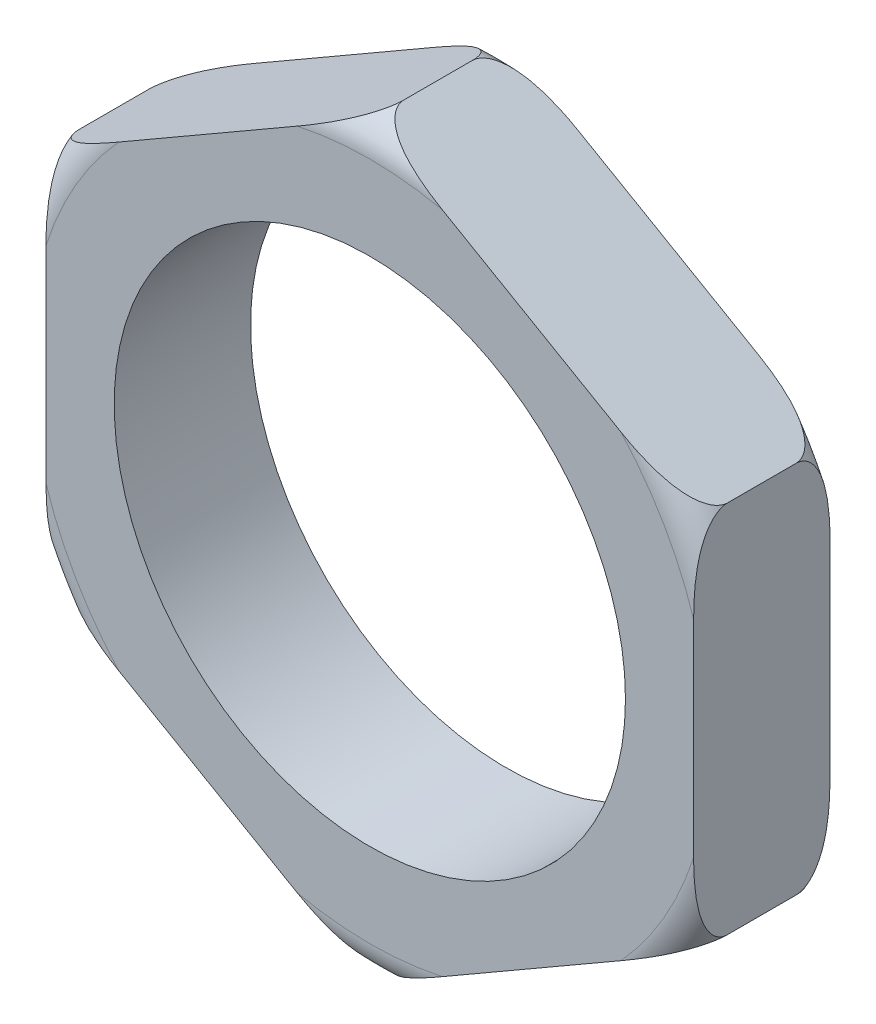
ISO-10303-21;
HEADER;
FILE_DESCRIPTION(('STEP AP214'),'2;1');
FILE_NAME('part.step','',(''),(''),'','','');
FILE_SCHEMA(('AUTOMOTIVE_DESIGN { 1 0 10303 214 1 1 1 1 }'));
ENDSEC;
DATA;
#1=APPLICATION_CONTEXT('core data for automotive mechanical design processes');
#2=APPLICATION_PROTOCOL_DEFINITION('international standard','automotive_design',2000,#1);
#3=PRODUCT_CONTEXT('',#1,'mechanical');
#4=PRODUCT('Part','Part','',(#3));
#5=PRODUCT_RELATED_PRODUCT_CATEGORY('part','',(#4));
#6=PRODUCT_DEFINITION_FORMATION('','',#4);
#7=PRODUCT_DEFINITION_CONTEXT('part definition',#1,'design');
#8=PRODUCT_DEFINITION('design','',#6,#7);
#9=PRODUCT_DEFINITION_SHAPE('','',#8);
#10=(LENGTH_UNIT() NAMED_UNIT(*) SI_UNIT(.MILLI.,.METRE.));
#11=(NAMED_UNIT(*) PLANE_ANGLE_UNIT() SI_UNIT($,.RADIAN.));
#12=(NAMED_UNIT(*) SI_UNIT($,.STERADIAN.) SOLID_ANGLE_UNIT());
#13=UNCERTAINTY_MEASURE_WITH_UNIT(LENGTH_MEASURE(1.E-05),#10,'distance_accuracy_value','');
#14=(GEOMETRIC_REPRESENTATION_CONTEXT(3) GLOBAL_UNCERTAINTY_ASSIGNED_CONTEXT((#13)) GLOBAL_UNIT_ASSIGNED_CONTEXT((#10,
#11,#12)) REPRESENTATION_CONTEXT('',''));
#15=CARTESIAN_POINT('',(0.,0.,0.));
#16=DIRECTION('',(0.,0.,1.));
#17=DIRECTION('',(1.,0.,0.));
#18=AXIS2_PLACEMENT_3D('',#15,#16,#17);
#19=CARTESIAN_POINT('',(0.,0.,15.5));
#20=DIRECTION('',(0.,0.,1.));
#21=DIRECTION('',(1.,0.,0.));
#22=AXIS2_PLACEMENT_3D('',#19,#20,#21);
#23=TOROIDAL_SURFACE('',#22,9.96965511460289,1.);
#24=CARTESIAN_POINT('',(9.5,3.02390858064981,14.5));
#25=CARTESIAN_POINT('',(9.5,3.88125681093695,14.5));
#26=CARTESIAN_POINT('',(9.5,4.44614894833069,14.6454097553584));
#27=CARTESIAN_POINT('',(9.5,4.84647059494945,14.7484571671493));
#28=CARTESIAN_POINT('',(9.5,5.10555316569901,14.9210536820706));
#29=CARTESIAN_POINT('',(9.5,5.27201082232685,15.0319450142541));
#30=CARTESIAN_POINT('',(9.5,5.36829139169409,15.1649452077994));
#31=CARTESIAN_POINT('',(9.5,5.48482755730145,15.3259261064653));
#32=CARTESIAN_POINT('',(9.5,5.48482755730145,15.5));
#33=B_SPLINE_CURVE_WITH_KNOTS('',2,(#24,#25,#26,#27,#28,#29,#30,#31,#32),.UNSPECIFIED.,.F.,.F.,
(3,2,2,2,3),(0.,0.5,0.75,0.875,1.),.UNSPECIFIED.);
#34=CARTESIAN_POINT('',(9.5,3.02390858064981,14.5));
#35=VERTEX_POINT('',#34);
#36=CARTESIAN_POINT('',(9.5,5.48482755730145,15.5));
#37=VERTEX_POINT('',#36);
#38=EDGE_CURVE('E510',#35,#37,#33,.T.);
#39=ORIENTED_EDGE('',*,*,#38,.F.);
#40=CARTESIAN_POINT('',(0.,0.,14.5));
#41=DIRECTION('',(0.,0.,1.));
#42=DIRECTION('',(1.,0.,0.));
#43=AXIS2_PLACEMENT_3D('',#40,#41,#42);
#44=CIRCLE('',#43,9.96965511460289);
#45=CARTESIAN_POINT('',(7.36878164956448,6.71528704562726,14.5));
#46=VERTEX_POINT('',#45);
#47=EDGE_CURVE('E652',#35,#46,#44,.T.);
#48=ORIENTED_EDGE('',*,*,#47,.T.);
#49=CARTESIAN_POINT('',(9.5,5.48482755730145,15.5));
#50=CARTESIAN_POINT('',(9.5,5.48482755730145,15.3253370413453));
#51=CARTESIAN_POINT('',(9.39786028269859,5.54379795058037,15.1630084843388));
#52=CARTESIAN_POINT('',(9.31453432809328,5.59190621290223,15.0305802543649));
#53=CARTESIAN_POINT('',(9.16885617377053,5.67601353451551,14.9189945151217));
#54=CARTESIAN_POINT('',(8.94447002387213,5.80556293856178,14.7471204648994));
#55=CARTESIAN_POINT('',(8.59618172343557,6.00664728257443,14.6441360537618));
#56=CARTESIAN_POINT('',(8.1087205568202,6.2880831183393,14.5));
#57=CARTESIAN_POINT('',(7.36878164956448,6.71528704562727,14.5));
#58=B_SPLINE_CURVE_WITH_KNOTS('',2,(#49,#50,#51,#52,#53,#54,#55,#56,#57),.UNSPECIFIED.,.F.,.F.,
(3,2,2,2,3),(0.,0.125,0.25,0.5,1.),.UNSPECIFIED.);
#59=EDGE_CURVE('E635',#37,#46,#58,.T.);
#60=ORIENTED_EDGE('',*,*,#59,.F.);
#61=EDGE_LOOP('',(#39,#48,#60));
#62=FACE_BOUND('',#61,.T.);
#63=ADVANCED_FACE('F17',(#62),#23,.T.);
#64=CARTESIAN_POINT('',(0.,0.,15.5));
#65=DIRECTION('',(0.,0.,1.));
#66=DIRECTION('',(1.,0.,0.));
#67=AXIS2_PLACEMENT_3D('',#64,#65,#66);
#68=TOROIDAL_SURFACE('',#67,9.96965511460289,1.);
#69=CARTESIAN_POINT('',(0.,0.,14.5));
#70=DIRECTION('',(0.,0.,1.));
#71=DIRECTION('',(1.,0.,0.));
#72=AXIS2_PLACEMENT_3D('',#69,#70,#71);
#73=CIRCLE('',#72,9.96965511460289);
#74=CARTESIAN_POINT('',(2.13121835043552,9.73919562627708,14.5));
#75=VERTEX_POINT('',#74);
#76=CARTESIAN_POINT('',(-2.13121835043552,9.73919562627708,14.5));
#77=VERTEX_POINT('',#76);
#78=EDGE_CURVE('E11',#75,#77,#73,.T.);
#79=ORIENTED_EDGE('',*,*,#78,.T.);
#80=CARTESIAN_POINT('',(0.,10.9696551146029,15.5));
#81=CARTESIAN_POINT('',(0.,10.9696551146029,15.3253370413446));
#82=CARTESIAN_POINT('',(-0.102139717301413,10.910684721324,15.1630084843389));
#83=CARTESIAN_POINT('',(-0.185465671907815,10.8625764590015,15.0305802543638));
#84=CARTESIAN_POINT('',(-0.331143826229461,10.7784691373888,14.9189945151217));
#85=CARTESIAN_POINT('',(-0.555529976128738,10.6489197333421,14.7471204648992));
#86=CARTESIAN_POINT('',(-0.903818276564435,10.4478353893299,14.6441360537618));
#87=CARTESIAN_POINT('',(-1.3912794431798,10.166399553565,14.5));
#88=CARTESIAN_POINT('',(-2.13121835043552,9.73919562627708,14.5));
#89=B_SPLINE_CURVE_WITH_KNOTS('',2,(#80,#81,#82,#83,#84,#85,#86,#87,#88),.UNSPECIFIED.,.F.,.F.,
(3,2,2,2,3),(0.,0.125,0.25,0.5,1.),.UNSPECIFIED.);
#90=CARTESIAN_POINT('',(0.,10.9696551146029,15.5));
#91=VERTEX_POINT('',#90);
#92=EDGE_CURVE('E207',#91,#77,#89,.T.);
#93=ORIENTED_EDGE('',*,*,#92,.F.);
#94=CARTESIAN_POINT('',(2.13121835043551,9.73919562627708,14.5));
#95=CARTESIAN_POINT('',(1.38867704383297,10.1679020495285,14.5));
#96=CARTESIAN_POINT('',(0.899457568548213,10.4503530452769,14.6454289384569));
#97=CARTESIAN_POINT('',(0.552712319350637,10.6505465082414,14.7485049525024));
#98=CARTESIAN_POINT('',(0.328351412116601,10.7800813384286,14.9211382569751));
#99=CARTESIAN_POINT('',(0.184382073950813,10.8632020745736,15.0319146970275));
#100=CARTESIAN_POINT('',(0.101063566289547,10.9113060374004,15.1647211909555));
#101=CARTESIAN_POINT('',(0.,10.9696551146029,15.3258126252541));
#102=CARTESIAN_POINT('',(0.,10.9696551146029,15.5));
#103=B_SPLINE_CURVE_WITH_KNOTS('',2,(#94,#95,#96,#97,#98,#99,#100,#101,#102),.UNSPECIFIED.,.F.,
.F.,(3,2,2,2,3),(0.,0.5,0.75,0.875,1.),.UNSPECIFIED.);
#104=EDGE_CURVE('E211',#75,#91,#103,.T.);
#105=ORIENTED_EDGE('',*,*,#104,.F.);
#106=EDGE_LOOP('',(#79,#93,#105));
#107=FACE_BOUND('',#106,.T.);
#108=ADVANCED_FACE('F205',(#107),#68,.T.);
#109=CARTESIAN_POINT('',(0.,0.,15.5));
#110=DIRECTION('',(0.,0.,1.));
#111=DIRECTION('',(1.,0.,0.));
#112=AXIS2_PLACEMENT_3D('',#109,#110,#111);
#113=TOROIDAL_SURFACE('',#112,9.96965511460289,1.);
#114=CARTESIAN_POINT('',(-7.36878164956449,6.71528704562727,14.5));
#115=CARTESIAN_POINT('',(-8.11132295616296,6.28658062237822,14.5));
#116=CARTESIAN_POINT('',(-8.60054243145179,6.00412962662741,14.6454289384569));
#117=CARTESIAN_POINT('',(-8.94728768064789,5.80393616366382,14.7485049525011));
#118=CARTESIAN_POINT('',(-9.17164858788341,5.67440133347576,14.9211382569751));
#119=CARTESIAN_POINT('',(-9.31561792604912,5.59128059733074,15.0319146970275));
#120=CARTESIAN_POINT('',(-9.39893643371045,5.54317663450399,15.1647211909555));
#121=CARTESIAN_POINT('',(-9.50000000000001,5.48482755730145,15.3258126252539));
#122=CARTESIAN_POINT('',(-9.50000000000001,5.48482755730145,15.5));
#123=B_SPLINE_CURVE_WITH_KNOTS('',2,(#114,#115,#116,#117,#118,#119,#120,#121,#122),
.UNSPECIFIED.,.F.,.F.,(3,2,2,2,3),(0.,0.5,0.75,0.875,1.),.UNSPECIFIED.);
#124=CARTESIAN_POINT('',(-7.36878164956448,6.71528704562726,14.5));
#125=VERTEX_POINT('',#124);
#126=CARTESIAN_POINT('',(-9.5,5.48482755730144,15.5));
#127=VERTEX_POINT('',#126);
#128=EDGE_CURVE('E220',#125,#127,#123,.T.);
#129=ORIENTED_EDGE('',*,*,#128,.F.);
#130=CARTESIAN_POINT('',(0.,0.,14.5));
#131=DIRECTION('',(0.,0.,1.));
#132=DIRECTION('',(1.,0.,0.));
#133=AXIS2_PLACEMENT_3D('',#130,#131,#132);
#134=CIRCLE('',#133,9.96965511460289);
#135=CARTESIAN_POINT('',(-9.5,3.0239085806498,14.5));
#136=VERTEX_POINT('',#135);
#137=EDGE_CURVE('E31',#125,#136,#134,.T.);
#138=ORIENTED_EDGE('',*,*,#137,.T.);
#139=CARTESIAN_POINT('',(-9.5,5.48482755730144,15.5));
#140=CARTESIAN_POINT('',(-9.5,5.48482755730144,15.3253112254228));
#141=CARTESIAN_POINT('',(-9.5,5.3668455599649,15.1629518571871));
#142=CARTESIAN_POINT('',(-9.5,5.27060561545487,15.0305125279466));
#143=CARTESIAN_POINT('',(-9.5,5.10232945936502,14.918910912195));
#144=CARTESIAN_POINT('',(-9.5,4.84280265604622,14.746791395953));
#145=CARTESIAN_POINT('',(-9.5,4.43979630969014,14.6437801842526));
#146=CARTESIAN_POINT('',(-9.5,3.87729126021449,14.5));
#147=CARTESIAN_POINT('',(-9.5,3.0239085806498,14.5));
#148=B_SPLINE_CURVE_WITH_KNOTS('',2,(#139,#140,#141,#142,#143,#144,#145,#146,#147),
.UNSPECIFIED.,.F.,.F.,(3,2,2,2,3),(0.,0.125,0.25,0.5,1.),.UNSPECIFIED.);
#149=EDGE_CURVE('E227',#127,#136,#148,.T.);
#150=ORIENTED_EDGE('',*,*,#149,.F.);
#151=EDGE_LOOP('',(#129,#138,#150));
#152=FACE_BOUND('',#151,.T.);
#153=ADVANCED_FACE('F282',(#152),#113,.T.);
#154=CARTESIAN_POINT('',(0.,0.,15.5));
#155=DIRECTION('',(0.,0.,1.));
#156=DIRECTION('',(1.,0.,0.));
#157=AXIS2_PLACEMENT_3D('',#154,#155,#156);
#158=TOROIDAL_SURFACE('',#157,9.96965511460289,1.);
#159=CARTESIAN_POINT('',(-9.5,-3.0239085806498,14.5));
#160=CARTESIAN_POINT('',(-9.5,-3.88125681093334,14.5));
#161=CARTESIAN_POINT('',(-9.5,-4.44614894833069,14.6454097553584));
#162=CARTESIAN_POINT('',(-9.5,-4.84647059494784,14.7484571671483));
#163=CARTESIAN_POINT('',(-9.5,-5.105553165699,14.9210536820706));
#164=CARTESIAN_POINT('',(-9.5,-5.27201082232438,15.0319450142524));
#165=CARTESIAN_POINT('',(-9.5,-5.3682913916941,15.1649452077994));
#166=CARTESIAN_POINT('',(-9.5,-5.48482755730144,15.3259261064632));
#167=CARTESIAN_POINT('',(-9.5,-5.48482755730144,15.5));
#168=B_SPLINE_CURVE_WITH_KNOTS('',2,(#159,#160,#161,#162,#163,#164,#165,#166,#167),
.UNSPECIFIED.,.F.,.F.,(3,2,2,2,3),(0.,0.5,0.75,0.875,1.),.UNSPECIFIED.);
#169=CARTESIAN_POINT('',(-9.5,-3.0239085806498,14.5));
#170=VERTEX_POINT('',#169);
#171=CARTESIAN_POINT('',(-9.5,-5.48482755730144,15.5));
#172=VERTEX_POINT('',#171);
#173=EDGE_CURVE('E313',#170,#172,#168,.T.);
#174=ORIENTED_EDGE('',*,*,#173,.F.);
#175=CARTESIAN_POINT('',(0.,0.,14.5));
#176=DIRECTION('',(0.,0.,1.));
#177=DIRECTION('',(1.,0.,0.));
#178=AXIS2_PLACEMENT_3D('',#175,#176,#177);
#179=CIRCLE('',#178,9.96965511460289);
#180=CARTESIAN_POINT('',(-7.36878164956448,-6.71528704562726,14.5));
#181=VERTEX_POINT('',#180);
#182=EDGE_CURVE('E401',#170,#181,#179,.T.);
#183=ORIENTED_EDGE('',*,*,#182,.T.);
#184=CARTESIAN_POINT('',(-9.5,-5.48482755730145,15.5));
#185=CARTESIAN_POINT('',(-9.5,-5.48482755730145,15.3253370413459));
#186=CARTESIAN_POINT('',(-9.39786028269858,-5.54379795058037,15.1630084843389));
#187=CARTESIAN_POINT('',(-9.31453432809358,-5.59190621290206,15.0305802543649));
#188=CARTESIAN_POINT('',(-9.16885617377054,-5.67601353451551,14.9189945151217));
#189=CARTESIAN_POINT('',(-8.94447002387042,-5.80556293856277,14.7471204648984));
#190=CARTESIAN_POINT('',(-8.59618172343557,-6.00664728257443,14.6441360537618));
#191=CARTESIAN_POINT('',(-8.10872055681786,-6.28808311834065,14.5));
#192=CARTESIAN_POINT('',(-7.36878164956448,-6.71528704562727,14.5));
#193=B_SPLINE_CURVE_WITH_KNOTS('',2,(#184,#185,#186,#187,#188,#189,#190,#191,#192),
.UNSPECIFIED.,.F.,.F.,(3,2,2,2,3),(0.,0.125,0.25,0.5,1.),.UNSPECIFIED.);
#194=EDGE_CURVE('E376',#172,#181,#193,.T.);
#195=ORIENTED_EDGE('',*,*,#194,.F.);
#196=EDGE_LOOP('',(#174,#183,#195));
#197=FACE_BOUND('',#196,.T.);
#198=ADVANCED_FACE('F292',(#197),#158,.T.);
#199=CARTESIAN_POINT('',(0.,0.,15.5));
#200=DIRECTION('',(0.,0.,1.));
#201=DIRECTION('',(1.,0.,0.));
#202=AXIS2_PLACEMENT_3D('',#199,#200,#201);
#203=TOROIDAL_SURFACE('',#202,9.96965511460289,1.);
#204=CARTESIAN_POINT('',(-2.13121835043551,-9.73919562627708,14.5));
#205=CARTESIAN_POINT('',(-1.3886770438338,-10.167902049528,14.5));
#206=CARTESIAN_POINT('',(-0.899457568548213,-10.4503530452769,14.6454289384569));
#207=CARTESIAN_POINT('',(-0.552712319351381,-10.650546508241,14.748504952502));
#208=CARTESIAN_POINT('',(-0.328351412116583,-10.7800813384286,14.9211382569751));
#209=CARTESIAN_POINT('',(-0.184382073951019,-10.8632020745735,15.0319146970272));
#210=CARTESIAN_POINT('',(-0.101063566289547,-10.9113060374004,15.1647211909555));
#211=CARTESIAN_POINT('',(0.,-10.9696551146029,15.325812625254));
#212=CARTESIAN_POINT('',(0.,-10.9696551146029,15.5));
#213=B_SPLINE_CURVE_WITH_KNOTS('',2,(#204,#205,#206,#207,#208,#209,#210,#211,#212),
.UNSPECIFIED.,.F.,.F.,(3,2,2,2,3),(0.,0.5,0.75,0.875,1.),.UNSPECIFIED.);
#214=CARTESIAN_POINT('',(-2.13121835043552,-9.73919562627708,14.5));
#215=VERTEX_POINT('',#214);
#216=CARTESIAN_POINT('',(0.,-10.9696551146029,15.5));
#217=VERTEX_POINT('',#216);
#218=EDGE_CURVE('E770',#215,#217,#213,.T.);
#219=ORIENTED_EDGE('',*,*,#218,.F.);
#220=CARTESIAN_POINT('',(0.,0.,14.5));
#221=DIRECTION('',(0.,0.,1.));
#222=DIRECTION('',(1.,0.,0.));
#223=AXIS2_PLACEMENT_3D('',#220,#221,#222);
#224=CIRCLE('',#223,9.96965511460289);
#225=CARTESIAN_POINT('',(2.13121835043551,-9.73919562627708,14.5));
#226=VERTEX_POINT('',#225);
#227=EDGE_CURVE('E756',#215,#226,#224,.T.);
#228=ORIENTED_EDGE('',*,*,#227,.T.);
#229=CARTESIAN_POINT('',(0.,-10.9696551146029,15.5));
#230=CARTESIAN_POINT('',(0.,-10.9696551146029,15.3253370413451));
#231=CARTESIAN_POINT('',(0.102139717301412,-10.910684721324,15.1630084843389));
#232=CARTESIAN_POINT('',(0.185465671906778,-10.8625764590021,15.030580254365));
#233=CARTESIAN_POINT('',(0.33114382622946,-10.7784691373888,14.9189945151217));
#234=CARTESIAN_POINT('',(0.555529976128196,-10.6489197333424,14.7471204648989));
#235=CARTESIAN_POINT('',(0.903818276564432,-10.4478353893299,14.6441360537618));
#236=CARTESIAN_POINT('',(1.39127944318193,-10.1663995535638,14.5));
#237=CARTESIAN_POINT('',(2.13121835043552,-9.73919562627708,14.5));
#238=B_SPLINE_CURVE_WITH_KNOTS('',2,(#229,#230,#231,#232,#233,#234,#235,#236,#237),
.UNSPECIFIED.,.F.,.F.,(3,2,2,2,3),(0.,0.125,0.25,0.5,1.),.UNSPECIFIED.);
#239=EDGE_CURVE('E784',#217,#226,#238,.T.);
#240=ORIENTED_EDGE('',*,*,#239,.F.);
#241=EDGE_LOOP('',(#219,#228,#240));
#242=FACE_BOUND('',#241,.T.);
#243=ADVANCED_FACE('F412',(#242),#203,.T.);
#244=CARTESIAN_POINT('',(0.,0.,15.5));
#245=DIRECTION('',(0.,0.,1.));
#246=DIRECTION('',(1.,0.,0.));
#247=AXIS2_PLACEMENT_3D('',#244,#245,#246);
#248=TOROIDAL_SURFACE('',#247,9.96965511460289,1.);
#249=CARTESIAN_POINT('',(7.36878164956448,-6.71528704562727,14.5));
#250=CARTESIAN_POINT('',(8.11132295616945,-6.28658062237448,14.5));
#251=CARTESIAN_POINT('',(8.60054243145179,-6.00412962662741,14.6454289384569));
#252=CARTESIAN_POINT('',(8.94728768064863,-5.80393616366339,14.7485049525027));
#253=CARTESIAN_POINT('',(9.17164858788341,-5.67440133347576,14.9211382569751));
#254=CARTESIAN_POINT('',(9.31561792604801,-5.59128059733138,15.031914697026));
#255=CARTESIAN_POINT('',(9.39893643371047,-5.54317663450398,15.1647211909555));
#256=CARTESIAN_POINT('',(9.50000000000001,-5.48482755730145,15.3258126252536));
#257=CARTESIAN_POINT('',(9.50000000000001,-5.48482755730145,15.5));
#258=B_SPLINE_CURVE_WITH_KNOTS('',2,(#249,#250,#251,#252,#253,#254,#255,#256,#257),
.UNSPECIFIED.,.F.,.F.,(3,2,2,2,3),(0.,0.5,0.75,0.875,1.),.UNSPECIFIED.);
#259=CARTESIAN_POINT('',(7.36878164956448,-6.71528704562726,14.5));
#260=VERTEX_POINT('',#259);
#261=CARTESIAN_POINT('',(9.5,-5.48482755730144,15.5));
#262=VERTEX_POINT('',#261);
#263=EDGE_CURVE('E476',#260,#262,#258,.T.);
#264=ORIENTED_EDGE('',*,*,#263,.F.);
#265=CARTESIAN_POINT('',(0.,0.,14.5));
#266=DIRECTION('',(0.,0.,1.));
#267=DIRECTION('',(1.,0.,0.));
#268=AXIS2_PLACEMENT_3D('',#265,#266,#267);
#269=CIRCLE('',#268,9.96965511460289);
#270=CARTESIAN_POINT('',(9.5,-3.02390858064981,14.5));
#271=VERTEX_POINT('',#270);
#272=EDGE_CURVE('E481',#260,#271,#269,.T.);
#273=ORIENTED_EDGE('',*,*,#272,.T.);
#274=CARTESIAN_POINT('',(9.5,-5.48482755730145,15.5));
#275=CARTESIAN_POINT('',(9.5,-5.48482755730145,15.3253112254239));
#276=CARTESIAN_POINT('',(9.5,-5.36684555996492,15.1629518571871));
#277=CARTESIAN_POINT('',(9.5,-5.27060561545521,15.0305125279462));
#278=CARTESIAN_POINT('',(9.5,-5.10232945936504,14.918910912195));
#279=CARTESIAN_POINT('',(9.5,-4.84280265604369,14.7467913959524));
#280=CARTESIAN_POINT('',(9.5,-4.43979630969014,14.6437801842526));
#281=CARTESIAN_POINT('',(9.5,-3.87729126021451,14.5));
#282=CARTESIAN_POINT('',(9.5,-3.02390858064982,14.5));
#283=B_SPLINE_CURVE_WITH_KNOTS('',2,(#274,#275,#276,#277,#278,#279,#280,#281,#282),
.UNSPECIFIED.,.F.,.F.,(3,2,2,2,3),(0.,0.125,0.25,0.5,1.),.UNSPECIFIED.);
#284=EDGE_CURVE('E872',#262,#271,#283,.T.);
#285=ORIENTED_EDGE('',*,*,#284,.F.);
#286=EDGE_LOOP('',(#264,#273,#285));
#287=FACE_BOUND('',#286,.T.);
#288=ADVANCED_FACE('F483',(#287),#248,.T.);
#289=CARTESIAN_POINT('',(0.,0.,17.5));
#290=DIRECTION('',(0.,0.,1.));
#291=DIRECTION('',(1.,0.,0.));
#292=AXIS2_PLACEMENT_3D('',#289,#290,#291);
#293=TOROIDAL_SURFACE('',#292,9.96965511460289,1.);
#294=CARTESIAN_POINT('',(0.,0.,18.5));
#295=DIRECTION('',(0.,0.,1.));
#296=DIRECTION('',(1.,0.,0.));
#297=AXIS2_PLACEMENT_3D('',#294,#295,#296);
#298=CIRCLE('',#297,9.96965511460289);
#299=CARTESIAN_POINT('',(9.5,3.02390858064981,18.5));
#300=VERTEX_POINT('',#299);
#301=CARTESIAN_POINT('',(7.36878164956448,6.71528704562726,18.5));
#302=VERTEX_POINT('',#301);
#303=EDGE_CURVE('E676',#300,#302,#298,.T.);
#304=ORIENTED_EDGE('',*,*,#303,.F.);
#305=CARTESIAN_POINT('',(9.5,5.48482755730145,17.5));
#306=CARTESIAN_POINT('',(9.5,5.48482755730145,17.6746887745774));
#307=CARTESIAN_POINT('',(9.5,5.36684555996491,17.8370481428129));
#308=CARTESIAN_POINT('',(9.5,5.27060561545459,17.9694874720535));
#309=CARTESIAN_POINT('',(9.5,5.10232945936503,18.081089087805));
#310=CARTESIAN_POINT('',(9.5,4.84280265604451,18.2532086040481));
#311=CARTESIAN_POINT('',(9.5,4.43979630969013,18.3562198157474));
#312=CARTESIAN_POINT('',(9.5,3.87729126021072,18.5));
#313=CARTESIAN_POINT('',(9.5,3.02390858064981,18.5));
#314=B_SPLINE_CURVE_WITH_KNOTS('',2,(#305,#306,#307,#308,#309,#310,#311,#312,#313),
.UNSPECIFIED.,.F.,.F.,(3,2,2,2,3),(0.,0.125,0.25,0.5,1.),.UNSPECIFIED.);
#315=CARTESIAN_POINT('',(9.5,5.48482755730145,17.5));
#316=VERTEX_POINT('',#315);
#317=EDGE_CURVE('E543',#316,#300,#314,.T.);
#318=ORIENTED_EDGE('',*,*,#317,.F.);
#319=CARTESIAN_POINT('',(7.36878164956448,6.71528704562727,18.5));
#320=CARTESIAN_POINT('',(8.11132295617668,6.2865806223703,18.5));
#321=CARTESIAN_POINT('',(8.60054243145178,6.00412962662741,18.3545710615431));
#322=CARTESIAN_POINT('',(8.94728768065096,5.80393616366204,18.2514950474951));
#323=CARTESIAN_POINT('',(9.1716485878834,5.67440133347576,18.0788617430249));
#324=CARTESIAN_POINT('',(9.31561792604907,5.59128059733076,17.9680853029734));
#325=CARTESIAN_POINT('',(9.39893643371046,5.54317663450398,17.8352788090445));
#326=CARTESIAN_POINT('',(9.5,5.48482755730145,17.674187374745));
#327=CARTESIAN_POINT('',(9.5,5.48482755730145,17.5));
#328=B_SPLINE_CURVE_WITH_KNOTS('',2,(#319,#320,#321,#322,#323,#324,#325,#326,#327),
.UNSPECIFIED.,.F.,.F.,(3,2,2,2,3),(0.,0.5,0.75,0.875,1.),.UNSPECIFIED.);
#329=EDGE_CURVE('E511',#302,#316,#328,.T.);
#330=ORIENTED_EDGE('',*,*,#329,.F.);
#331=EDGE_LOOP('',(#304,#318,#330));
#332=FACE_BOUND('',#331,.T.);
#333=ADVANCED_FACE('F491',(#332),#293,.T.);
#334=CARTESIAN_POINT('',(0.,0.,17.5));
#335=DIRECTION('',(0.,0.,1.));
#336=DIRECTION('',(1.,0.,0.));
#337=AXIS2_PLACEMENT_3D('',#334,#335,#336);
#338=TOROIDAL_SURFACE('',#337,9.96965511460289,1.);
#339=CARTESIAN_POINT('',(-2.13121835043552,9.73919562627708,18.5));
#340=CARTESIAN_POINT('',(-1.38867704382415,10.1679020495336,18.5));
#341=CARTESIAN_POINT('',(-0.899457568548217,10.4503530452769,18.3545710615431));
#342=CARTESIAN_POINT('',(-0.552712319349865,10.6505465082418,18.2514950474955));
#343=CARTESIAN_POINT('',(-0.328351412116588,10.7800813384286,18.0788617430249));
#344=CARTESIAN_POINT('',(-0.184382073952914,10.8632020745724,17.9680853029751));
#345=CARTESIAN_POINT('',(-0.101063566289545,10.9113060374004,17.8352788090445));
#346=CARTESIAN_POINT('',(0.,10.9696551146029,17.6741873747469));
#347=CARTESIAN_POINT('',(0.,10.9696551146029,17.5));
#348=B_SPLINE_CURVE_WITH_KNOTS('',2,(#339,#340,#341,#342,#343,#344,#345,#346,#347),
.UNSPECIFIED.,.F.,.F.,(3,2,2,2,3),(0.,0.5,0.75,0.875,1.),.UNSPECIFIED.);
#349=CARTESIAN_POINT('',(-2.13121835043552,9.73919562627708,18.5));
#350=VERTEX_POINT('',#349);
#351=CARTESIAN_POINT('',(0.,10.9696551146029,17.5));
#352=VERTEX_POINT('',#351);
#353=EDGE_CURVE('E672',#350,#352,#348,.T.);
#354=ORIENTED_EDGE('',*,*,#353,.F.);
#355=CARTESIAN_POINT('',(0.,0.,18.5));
#356=DIRECTION('',(0.,0.,1.));
#357=DIRECTION('',(1.,0.,0.));
#358=AXIS2_PLACEMENT_3D('',#355,#356,#357);
#359=CIRCLE('',#358,9.96965511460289);
#360=CARTESIAN_POINT('',(2.13121835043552,9.73919562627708,18.5));
#361=VERTEX_POINT('',#360);
#362=EDGE_CURVE('E46',#361,#350,#359,.T.);
#363=ORIENTED_EDGE('',*,*,#362,.F.);
#364=CARTESIAN_POINT('',(0.,10.9696551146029,17.5));
#365=CARTESIAN_POINT('',(0.,10.9696551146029,17.6746629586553));
#366=CARTESIAN_POINT('',(0.102139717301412,10.910684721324,17.8369915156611));
#367=CARTESIAN_POINT('',(0.185465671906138,10.8625764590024,17.9694197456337));
#368=CARTESIAN_POINT('',(0.331143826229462,10.7784691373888,18.0810054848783));
#369=CARTESIAN_POINT('',(0.555529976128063,10.6489197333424,18.2528795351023));
#370=CARTESIAN_POINT('',(0.90381827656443,10.4478353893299,18.3558639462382));
#371=CARTESIAN_POINT('',(1.39127944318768,10.1663995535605,18.5));
#372=CARTESIAN_POINT('',(2.13121835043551,9.73919562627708,18.5));
#373=B_SPLINE_CURVE_WITH_KNOTS('',2,(#364,#365,#366,#367,#368,#369,#370,#371,#372),
.UNSPECIFIED.,.F.,.F.,(3,2,2,2,3),(0.,0.125,0.25,0.5,1.),.UNSPECIFIED.);
#374=EDGE_CURVE('E589',#352,#361,#373,.T.);
#375=ORIENTED_EDGE('',*,*,#374,.F.);
#376=EDGE_LOOP('',(#354,#363,#375));
#377=FACE_BOUND('',#376,.T.);
#378=ADVANCED_FACE('F247',(#377),#338,.T.);
#379=CARTESIAN_POINT('',(0.,0.,17.5));
#380=DIRECTION('',(0.,0.,1.));
#381=DIRECTION('',(1.,0.,0.));
#382=AXIS2_PLACEMENT_3D('',#379,#380,#381);
#383=TOROIDAL_SURFACE('',#382,9.96965511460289,1.);
#384=CARTESIAN_POINT('',(0.,0.,18.5));
#385=DIRECTION('',(0.,0.,1.));
#386=DIRECTION('',(1.,0.,0.));
#387=AXIS2_PLACEMENT_3D('',#384,#385,#386);
#388=CIRCLE('',#387,9.96965511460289);
#389=CARTESIAN_POINT('',(-7.36878164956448,6.71528704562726,18.5));
#390=VERTEX_POINT('',#389);
#391=CARTESIAN_POINT('',(-9.5,3.0239085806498,18.5));
#392=VERTEX_POINT('',#391);
#393=EDGE_CURVE('E106',#390,#392,#388,.T.);
#394=ORIENTED_EDGE('',*,*,#393,.F.);
#395=CARTESIAN_POINT('',(-9.50000000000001,5.48482755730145,17.5));
#396=CARTESIAN_POINT('',(-9.50000000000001,5.48482755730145,17.6746629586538));
#397=CARTESIAN_POINT('',(-9.39786028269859,5.54379795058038,17.8369915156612));
#398=CARTESIAN_POINT('',(-9.3145343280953,5.59190621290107,17.9694197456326));
#399=CARTESIAN_POINT('',(-9.16885617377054,5.67601353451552,18.0810054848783));
#400=CARTESIAN_POINT('',(-8.94447002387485,5.80556293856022,18.2528795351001));
#401=CARTESIAN_POINT('',(-8.59618172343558,6.00664728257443,18.3558639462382));
#402=CARTESIAN_POINT('',(-8.10872055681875,6.28808311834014,18.5));
#403=CARTESIAN_POINT('',(-7.36878164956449,6.71528704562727,18.5));
#404=B_SPLINE_CURVE_WITH_KNOTS('',2,(#395,#396,#397,#398,#399,#400,#401,#402,#403),
.UNSPECIFIED.,.F.,.F.,(3,2,2,2,3),(0.,0.125,0.25,0.5,1.),.UNSPECIFIED.);
#405=CARTESIAN_POINT('',(-9.5,5.48482755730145,17.5));
#406=VERTEX_POINT('',#405);
#407=EDGE_CURVE('E683',#406,#390,#404,.T.);
#408=ORIENTED_EDGE('',*,*,#407,.F.);
#409=CARTESIAN_POINT('',(-9.5,3.0239085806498,18.5));
#410=CARTESIAN_POINT('',(-9.5,3.88125681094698,18.5));
#411=CARTESIAN_POINT('',(-9.5,4.44614894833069,18.3545902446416));
#412=CARTESIAN_POINT('',(-9.5,4.84647059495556,18.2515428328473));
#413=CARTESIAN_POINT('',(-9.5,5.10555316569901,18.0789463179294));
#414=CARTESIAN_POINT('',(-9.5,5.27201082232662,17.9680549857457));
#415=CARTESIAN_POINT('',(-9.5,5.3682913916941,17.8350547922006));
#416=CARTESIAN_POINT('',(-9.5,5.48482755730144,17.6740738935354));
#417=CARTESIAN_POINT('',(-9.5,5.48482755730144,17.5));
#418=B_SPLINE_CURVE_WITH_KNOTS('',2,(#409,#410,#411,#412,#413,#414,#415,#416,#417),
.UNSPECIFIED.,.F.,.F.,(3,2,2,2,3),(0.,0.5,0.75,0.875,1.),.UNSPECIFIED.);
#419=EDGE_CURVE('E322',#392,#406,#418,.T.);
#420=ORIENTED_EDGE('',*,*,#419,.F.);
#421=EDGE_LOOP('',(#394,#408,#420));
#422=FACE_BOUND('',#421,.T.);
#423=ADVANCED_FACE('F338',(#422),#383,.T.);
#424=CARTESIAN_POINT('',(0.,0.,17.5));
#425=DIRECTION('',(0.,0.,1.));
#426=DIRECTION('',(1.,0.,0.));
#427=AXIS2_PLACEMENT_3D('',#424,#425,#426);
#428=TOROIDAL_SURFACE('',#427,9.96965511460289,1.);
#429=CARTESIAN_POINT('',(0.,0.,18.5));
#430=DIRECTION('',(0.,0.,1.));
#431=DIRECTION('',(1.,0.,0.));
#432=AXIS2_PLACEMENT_3D('',#429,#430,#431);
#433=CIRCLE('',#432,9.96965511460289);
#434=CARTESIAN_POINT('',(-9.5,-3.0239085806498,18.5));
#435=VERTEX_POINT('',#434);
#436=CARTESIAN_POINT('',(-7.36878164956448,-6.71528704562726,18.5));
#437=VERTEX_POINT('',#436);
#438=EDGE_CURVE('E118',#435,#437,#433,.T.);
#439=ORIENTED_EDGE('',*,*,#438,.F.);
#440=CARTESIAN_POINT('',(-9.5,-5.48482755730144,17.5));
#441=CARTESIAN_POINT('',(-9.5,-5.48482755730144,17.6746887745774));
#442=CARTESIAN_POINT('',(-9.5,-5.36684555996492,17.8370481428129));
#443=CARTESIAN_POINT('',(-9.5,-5.27060561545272,17.9694874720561));
#444=CARTESIAN_POINT('',(-9.5,-5.10232945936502,18.081089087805));
#445=CARTESIAN_POINT('',(-9.5,-4.84280265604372,18.2532086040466));
#446=CARTESIAN_POINT('',(-9.5,-4.43979630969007,18.3562198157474));
#447=CARTESIAN_POINT('',(-9.5,-3.87729126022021,18.5));
#448=CARTESIAN_POINT('',(-9.5,-3.0239085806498,18.5));
#449=B_SPLINE_CURVE_WITH_KNOTS('',2,(#440,#441,#442,#443,#444,#445,#446,#447,#448),
.UNSPECIFIED.,.F.,.F.,(3,2,2,2,3),(0.,0.125,0.25,0.5,1.),.UNSPECIFIED.);
#450=CARTESIAN_POINT('',(-9.5,-5.48482755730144,17.5));
#451=VERTEX_POINT('',#450);
#452=EDGE_CURVE('E362',#451,#435,#449,.T.);
#453=ORIENTED_EDGE('',*,*,#452,.F.);
#454=CARTESIAN_POINT('',(-7.36878164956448,-6.71528704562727,18.5));
#455=CARTESIAN_POINT('',(-8.11132295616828,-6.28658062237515,18.5));
#456=CARTESIAN_POINT('',(-8.60054243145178,-6.00412962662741,18.3545710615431));
#457=CARTESIAN_POINT('',(-8.94728768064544,-5.80393616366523,18.2514950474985));
#458=CARTESIAN_POINT('',(-9.17164858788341,-5.67440133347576,18.0788617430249));
#459=CARTESIAN_POINT('',(-9.31561792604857,-5.59128059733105,17.9680853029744));
#460=CARTESIAN_POINT('',(-9.39893643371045,-5.54317663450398,17.8352788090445));
#461=CARTESIAN_POINT('',(-9.5,-5.48482755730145,17.6741873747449));
#462=CARTESIAN_POINT('',(-9.5,-5.48482755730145,17.5));
#463=B_SPLINE_CURVE_WITH_KNOTS('',2,(#454,#455,#456,#457,#458,#459,#460,#461,#462),
.UNSPECIFIED.,.F.,.F.,(3,2,2,2,3),(0.,0.5,0.75,0.875,1.),.UNSPECIFIED.);
#464=EDGE_CURVE('E314',#437,#451,#463,.T.);
#465=ORIENTED_EDGE('',*,*,#464,.F.);
#466=EDGE_LOOP('',(#439,#453,#465));
#467=FACE_BOUND('',#466,.T.);
#468=ADVANCED_FACE('F19',(#467),#428,.T.);
#469=CARTESIAN_POINT('',(0.,0.,17.5));
#470=DIRECTION('',(0.,0.,1.));
#471=DIRECTION('',(1.,0.,0.));
#472=AXIS2_PLACEMENT_3D('',#469,#470,#471);
#473=TOROIDAL_SURFACE('',#472,9.96965511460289,1.);
#474=CARTESIAN_POINT('',(0.,0.,18.5));
#475=DIRECTION('',(0.,0.,1.));
#476=DIRECTION('',(1.,0.,0.));
#477=AXIS2_PLACEMENT_3D('',#474,#475,#476);
#478=CIRCLE('',#477,9.96965511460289);
#479=CARTESIAN_POINT('',(-2.13121835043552,-9.73919562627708,18.5));
#480=VERTEX_POINT('',#479);
#481=CARTESIAN_POINT('',(2.13121835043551,-9.73919562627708,18.5));
#482=VERTEX_POINT('',#481);
#483=EDGE_CURVE('E382',#480,#482,#478,.T.);
#484=ORIENTED_EDGE('',*,*,#483,.F.);
#485=CARTESIAN_POINT('',(0.,-10.9696551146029,17.5));
#486=CARTESIAN_POINT('',(0.,-10.9696551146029,17.6746629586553));
#487=CARTESIAN_POINT('',(-0.102139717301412,-10.910684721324,17.8369915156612));
#488=CARTESIAN_POINT('',(-0.18546567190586,-10.8625764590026,17.9694197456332));
#489=CARTESIAN_POINT('',(-0.331143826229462,-10.7784691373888,18.0810054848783));
#490=CARTESIAN_POINT('',(-0.555529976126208,-10.6489197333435,18.2528795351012));
#491=CARTESIAN_POINT('',(-0.90381827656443,-10.4478353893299,18.3558639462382));
#492=CARTESIAN_POINT('',(-1.39127944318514,-10.166399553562,18.5));
#493=CARTESIAN_POINT('',(-2.13121835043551,-9.73919562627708,18.5));
#494=B_SPLINE_CURVE_WITH_KNOTS('',2,(#485,#486,#487,#488,#489,#490,#491,#492,#493),
.UNSPECIFIED.,.F.,.F.,(3,2,2,2,3),(0.,0.125,0.25,0.5,1.),.UNSPECIFIED.);
#495=CARTESIAN_POINT('',(0.,-10.9696551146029,17.5));
#496=VERTEX_POINT('',#495);
#497=EDGE_CURVE('E766',#496,#480,#494,.T.);
#498=ORIENTED_EDGE('',*,*,#497,.F.);
#499=CARTESIAN_POINT('',(2.13121835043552,-9.73919562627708,18.5));
#500=CARTESIAN_POINT('',(1.38867704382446,-10.1679020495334,18.5));
#501=CARTESIAN_POINT('',(0.89945756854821,-10.4503530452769,18.3545710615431));
#502=CARTESIAN_POINT('',(0.552712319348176,-10.6505465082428,18.2514950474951));
#503=CARTESIAN_POINT('',(0.328351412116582,-10.7800813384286,18.0788617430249));
#504=CARTESIAN_POINT('',(0.184382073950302,-10.8632020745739,17.9680853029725));
#505=CARTESIAN_POINT('',(0.101063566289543,-10.9113060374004,17.8352788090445));
#506=CARTESIAN_POINT('',(0.,-10.9696551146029,17.6741873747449));
#507=CARTESIAN_POINT('',(0.,-10.9696551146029,17.5));
#508=B_SPLINE_CURVE_WITH_KNOTS('',2,(#499,#500,#501,#502,#503,#504,#505,#506,#507),
.UNSPECIFIED.,.F.,.F.,(3,2,2,2,3),(0.,0.5,0.75,0.875,1.),.UNSPECIFIED.);
#509=EDGE_CURVE('E377',#482,#496,#508,.T.);
#510=ORIENTED_EDGE('',*,*,#509,.F.);
#511=EDGE_LOOP('',(#484,#498,#510));
#512=FACE_BOUND('',#511,.T.);
#513=ADVANCED_FACE('F294',(#512),#473,.T.);
#514=CARTESIAN_POINT('',(0.,0.,17.5));
#515=DIRECTION('',(0.,0.,1.));
#516=DIRECTION('',(1.,0.,0.));
#517=AXIS2_PLACEMENT_3D('',#514,#515,#516);
#518=TOROIDAL_SURFACE('',#517,9.96965511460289,1.);
#519=CARTESIAN_POINT('',(0.,0.,18.5));
#520=DIRECTION('',(0.,0.,1.));
#521=DIRECTION('',(1.,0.,0.));
#522=AXIS2_PLACEMENT_3D('',#519,#520,#521);
#523=CIRCLE('',#522,9.96965511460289);
#524=CARTESIAN_POINT('',(7.36878164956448,-6.71528704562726,18.5));
#525=VERTEX_POINT('',#524);
#526=CARTESIAN_POINT('',(9.5,-3.02390858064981,18.5));
#527=VERTEX_POINT('',#526);
#528=EDGE_CURVE('E748',#525,#527,#523,.T.);
#529=ORIENTED_EDGE('',*,*,#528,.F.);
#530=CARTESIAN_POINT('',(9.50000000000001,-5.48482755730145,17.5));
#531=CARTESIAN_POINT('',(9.50000000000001,-5.48482755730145,17.6746629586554));
#532=CARTESIAN_POINT('',(9.39786028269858,-5.54379795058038,17.8369915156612));
#533=CARTESIAN_POINT('',(9.31453432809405,-5.59190621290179,17.9694197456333));
#534=CARTESIAN_POINT('',(9.16885617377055,-5.67601353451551,18.0810054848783));
#535=CARTESIAN_POINT('',(8.94447002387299,-5.80556293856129,18.2528795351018));
#536=CARTESIAN_POINT('',(8.59618172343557,-6.00664728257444,18.3558639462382));
#537=CARTESIAN_POINT('',(8.10872055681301,-6.28808311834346,18.5));
#538=CARTESIAN_POINT('',(7.36878164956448,-6.71528704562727,18.5));
#539=B_SPLINE_CURVE_WITH_KNOTS('',2,(#530,#531,#532,#533,#534,#535,#536,#537,#538),
.UNSPECIFIED.,.F.,.F.,(3,2,2,2,3),(0.,0.125,0.25,0.5,1.),.UNSPECIFIED.);
#540=CARTESIAN_POINT('',(9.5,-5.48482755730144,17.5));
#541=VERTEX_POINT('',#540);
#542=EDGE_CURVE('E856',#541,#525,#539,.T.);
#543=ORIENTED_EDGE('',*,*,#542,.F.);
#544=CARTESIAN_POINT('',(9.5,-3.02390858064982,18.5));
#545=CARTESIAN_POINT('',(9.5,-3.88125681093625,18.5));
#546=CARTESIAN_POINT('',(9.5,-4.4461489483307,18.3545902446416));
#547=CARTESIAN_POINT('',(9.5,-4.84647059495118,18.2515428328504));
#548=CARTESIAN_POINT('',(9.5,-5.10555316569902,18.0789463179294));
#549=CARTESIAN_POINT('',(9.5,-5.2720108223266,17.9680549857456));
#550=CARTESIAN_POINT('',(9.5,-5.36829139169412,17.8350547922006));
#551=CARTESIAN_POINT('',(9.5,-5.48482755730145,17.6740738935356));
#552=CARTESIAN_POINT('',(9.5,-5.48482755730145,17.5));
#553=B_SPLINE_CURVE_WITH_KNOTS('',2,(#544,#545,#546,#547,#548,#549,#550,#551,#552),
.UNSPECIFIED.,.F.,.F.,(3,2,2,2,3),(0.,0.5,0.75,0.875,1.),.UNSPECIFIED.);
#554=EDGE_CURVE('E520',#527,#541,#553,.T.);
#555=ORIENTED_EDGE('',*,*,#554,.F.);
#556=EDGE_LOOP('',(#529,#543,#555));
#557=FACE_BOUND('',#556,.T.);
#558=ADVANCED_FACE('F492',(#557),#518,.T.);
#559=CARTESIAN_POINT('',(0.,10.9696551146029,14.5));
#560=DIRECTION('',(0.,0.,1.));
#561=DIRECTION('',(1.,0.,0.));
#562=AXIS2_PLACEMENT_3D('',#559,#560,#561);
#563=PLANE('',#562);
#564=CARTESIAN_POINT('',(0.,0.,14.5));
#565=DIRECTION('',(0.,0.,1.));
#566=DIRECTION('',(1.,0.,0.));
#567=AXIS2_PLACEMENT_3D('',#564,#565,#566);
#568=CIRCLE('',#567,7.5);
#569=CARTESIAN_POINT('',(7.5,0.,14.5));
#570=VERTEX_POINT('',#569);
#571=EDGE_CURVE('E662',#570,#570,#568,.T.);
#572=ORIENTED_EDGE('',*,*,#571,.T.);
#573=EDGE_LOOP('',(#572));
#574=FACE_BOUND('',#573,.T.);
#575=ORIENTED_EDGE('',*,*,#47,.F.);
#576=DIRECTION('',(0.,1.,0.));
#577=VECTOR('',#576,1.);
#578=CARTESIAN_POINT('',(9.5,-5.48482755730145,14.5));
#579=LINE('',#578,#577);
#580=EDGE_CURVE('E501',#271,#35,#579,.T.);
#581=ORIENTED_EDGE('',*,*,#580,.F.);
#582=ORIENTED_EDGE('',*,*,#272,.F.);
#583=DIRECTION('',(0.866025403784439,0.5,0.));
#584=VECTOR('',#583,1.);
#585=CARTESIAN_POINT('',(0.,-10.9696551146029,14.5));
#586=LINE('',#585,#584);
#587=EDGE_CURVE('E782',#226,#260,#586,.T.);
#588=ORIENTED_EDGE('',*,*,#587,.F.);
#589=ORIENTED_EDGE('',*,*,#227,.F.);
#590=DIRECTION('',(0.866025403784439,-0.5,0.));
#591=VECTOR('',#590,1.);
#592=CARTESIAN_POINT('',(-9.5,-5.48482755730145,14.5));
#593=LINE('',#592,#591);
#594=EDGE_CURVE('E835',#181,#215,#593,.T.);
#595=ORIENTED_EDGE('',*,*,#594,.F.);
#596=ORIENTED_EDGE('',*,*,#182,.F.);
#597=DIRECTION('',(0.,-1.,0.));
#598=VECTOR('',#597,1.);
#599=CARTESIAN_POINT('',(-9.5,5.48482755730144,14.5));
#600=LINE('',#599,#598);
#601=EDGE_CURVE('E304',#136,#170,#600,.T.);
#602=ORIENTED_EDGE('',*,*,#601,.F.);
#603=ORIENTED_EDGE('',*,*,#137,.F.);
#604=DIRECTION('',(-0.866025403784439,-0.5,0.));
#605=VECTOR('',#604,1.);
#606=CARTESIAN_POINT('',(0.,10.9696551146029,14.5));
#607=LINE('',#606,#605);
#608=EDGE_CURVE('E216',#77,#125,#607,.T.);
#609=ORIENTED_EDGE('',*,*,#608,.F.);
#610=ORIENTED_EDGE('',*,*,#78,.F.);
#611=DIRECTION('',(-0.866025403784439,0.5,0.));
#612=VECTOR('',#611,1.);
#613=CARTESIAN_POINT('',(9.5,5.48482755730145,14.5));
#614=LINE('',#613,#612);
#615=EDGE_CURVE('E627',#46,#75,#614,.T.);
#616=ORIENTED_EDGE('',*,*,#615,.F.);
#617=EDGE_LOOP('',(#575,#581,#582,#588,#589,#595,#596,#602,#603,#609,#610,#616));
#618=FACE_BOUND('',#617,.T.);
#619=ADVANCED_FACE('F217',(#574,#618),#563,.F.);
#620=CARTESIAN_POINT('',(0.,10.9696551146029,18.5));
#621=DIRECTION('',(0.,0.,1.));
#622=DIRECTION('',(1.,0.,0.));
#623=AXIS2_PLACEMENT_3D('',#620,#621,#622);
#624=PLANE('',#623);
#625=CARTESIAN_POINT('',(0.,0.,18.5));
#626=DIRECTION('',(0.,0.,1.));
#627=DIRECTION('',(1.,0.,0.));
#628=AXIS2_PLACEMENT_3D('',#625,#626,#627);
#629=CIRCLE('',#628,7.5);
#630=CARTESIAN_POINT('',(7.5,0.,18.5));
#631=VERTEX_POINT('',#630);
#632=EDGE_CURVE('E656',#631,#631,#629,.T.);
#633=ORIENTED_EDGE('',*,*,#632,.F.);
#634=EDGE_LOOP('',(#633));
#635=FACE_BOUND('',#634,.T.);
#636=DIRECTION('',(0.,1.,0.));
#637=VECTOR('',#636,1.);
#638=CARTESIAN_POINT('',(9.5,-5.48482755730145,18.5));
#639=LINE('',#638,#637);
#640=EDGE_CURVE('E534',#527,#300,#639,.T.);
#641=ORIENTED_EDGE('',*,*,#640,.T.);
#642=ORIENTED_EDGE('',*,*,#303,.T.);
#643=DIRECTION('',(-0.866025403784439,0.5,0.));
#644=VECTOR('',#643,1.);
#645=CARTESIAN_POINT('',(9.5,5.48482755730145,18.5));
#646=LINE('',#645,#644);
#647=EDGE_CURVE('E581',#302,#361,#646,.T.);
#648=ORIENTED_EDGE('',*,*,#647,.T.);
#649=ORIENTED_EDGE('',*,*,#362,.T.);
#650=DIRECTION('',(-0.866025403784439,-0.5,0.));
#651=VECTOR('',#650,1.);
#652=CARTESIAN_POINT('',(0.,10.9696551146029,18.5));
#653=LINE('',#652,#651);
#654=EDGE_CURVE('E674',#350,#390,#653,.T.);
#655=ORIENTED_EDGE('',*,*,#654,.T.);
#656=ORIENTED_EDGE('',*,*,#393,.T.);
#657=DIRECTION('',(0.,-1.,0.));
#658=VECTOR('',#657,1.);
#659=CARTESIAN_POINT('',(-9.5,5.48482755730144,18.5));
#660=LINE('',#659,#658);
#661=EDGE_CURVE('E779',#392,#435,#660,.T.);
#662=ORIENTED_EDGE('',*,*,#661,.T.);
#663=ORIENTED_EDGE('',*,*,#438,.T.);
#664=DIRECTION('',(0.866025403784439,-0.5,0.));
#665=VECTOR('',#664,1.);
#666=CARTESIAN_POINT('',(-9.5,-5.48482755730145,18.5));
#667=LINE('',#666,#665);
#668=EDGE_CURVE('E769',#437,#480,#667,.T.);
#669=ORIENTED_EDGE('',*,*,#668,.T.);
#670=ORIENTED_EDGE('',*,*,#483,.T.);
#671=DIRECTION('',(0.866025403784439,0.5,0.));
#672=VECTOR('',#671,1.);
#673=CARTESIAN_POINT('',(0.,-10.9696551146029,18.5));
#674=LINE('',#673,#672);
#675=EDGE_CURVE('E737',#482,#525,#674,.T.);
#676=ORIENTED_EDGE('',*,*,#675,.T.);
#677=ORIENTED_EDGE('',*,*,#528,.T.);
#678=EDGE_LOOP('',(#641,#642,#648,#649,#655,#656,#662,#663,#669,#670,#676,#677));
#679=FACE_BOUND('',#678,.T.);
#680=ADVANCED_FACE('F244',(#635,#679),#624,.T.);
#681=CARTESIAN_POINT('',(0.,10.9696551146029,14.5));
#682=DIRECTION('',(-0.5,0.866025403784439,0.));
#683=DIRECTION('',(0.,0.,1.));
#684=AXIS2_PLACEMENT_3D('',#681,#682,#683);
#685=PLANE('',#684);
#686=DIRECTION('',(0.,0.,1.));
#687=VECTOR('',#686,1.);
#688=CARTESIAN_POINT('',(0.,10.9696551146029,14.5));
#689=LINE('',#688,#687);
#690=EDGE_CURVE('E225',#91,#352,#689,.T.);
#691=ORIENTED_EDGE('',*,*,#690,.F.);
#692=ORIENTED_EDGE('',*,*,#92,.T.);
#693=ORIENTED_EDGE('',*,*,#608,.T.);
#694=ORIENTED_EDGE('',*,*,#128,.T.);
#695=DIRECTION('',(0.,0.,1.));
#696=VECTOR('',#695,1.);
#697=CARTESIAN_POINT('',(-9.5,5.48482755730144,14.5));
#698=LINE('',#697,#696);
#699=EDGE_CURVE('E699',#127,#406,#698,.T.);
#700=ORIENTED_EDGE('',*,*,#699,.T.);
#701=ORIENTED_EDGE('',*,*,#407,.T.);
#702=ORIENTED_EDGE('',*,*,#654,.F.);
#703=ORIENTED_EDGE('',*,*,#353,.T.);
#704=EDGE_LOOP('',(#691,#692,#693,#694,#700,#701,#702,#703));
#705=FACE_BOUND('',#704,.T.);
#706=ADVANCED_FACE('F223',(#705),#685,.T.);
#707=CARTESIAN_POINT('',(-9.5,5.48482755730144,14.5));
#708=DIRECTION('',(-1.,0.,0.));
#709=DIRECTION('',(0.,0.,1.));
#710=AXIS2_PLACEMENT_3D('',#707,#708,#709);
#711=PLANE('',#710);
#712=ORIENTED_EDGE('',*,*,#601,.T.);
#713=ORIENTED_EDGE('',*,*,#173,.T.);
#714=DIRECTION('',(0.,0.,1.));
#715=VECTOR('',#714,1.);
#716=CARTESIAN_POINT('',(-9.5,-5.48482755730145,14.5));
#717=LINE('',#716,#715);
#718=EDGE_CURVE('E367',#172,#451,#717,.T.);
#719=ORIENTED_EDGE('',*,*,#718,.T.);
#720=ORIENTED_EDGE('',*,*,#452,.T.);
#721=ORIENTED_EDGE('',*,*,#661,.F.);
#722=ORIENTED_EDGE('',*,*,#419,.T.);
#723=ORIENTED_EDGE('',*,*,#699,.F.);
#724=ORIENTED_EDGE('',*,*,#149,.T.);
#725=EDGE_LOOP('',(#712,#713,#719,#720,#721,#722,#723,#724));
#726=FACE_BOUND('',#725,.T.);
#727=ADVANCED_FACE('F243',(#726),#711,.T.);
#728=CARTESIAN_POINT('',(-9.5,-5.48482755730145,14.5));
#729=DIRECTION('',(-0.5,-0.866025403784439,0.));
#730=DIRECTION('',(-0.866025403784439,0.5,0.));
#731=AXIS2_PLACEMENT_3D('',#728,#729,#730);
#732=PLANE('',#731);
#733=ORIENTED_EDGE('',*,*,#718,.F.);
#734=ORIENTED_EDGE('',*,*,#194,.T.);
#735=ORIENTED_EDGE('',*,*,#594,.T.);
#736=ORIENTED_EDGE('',*,*,#218,.T.);
#737=DIRECTION('',(0.,0.,1.));
#738=VECTOR('',#737,1.);
#739=CARTESIAN_POINT('',(0.,-10.9696551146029,14.5));
#740=LINE('',#739,#738);
#741=EDGE_CURVE('E811',#217,#496,#740,.T.);
#742=ORIENTED_EDGE('',*,*,#741,.T.);
#743=ORIENTED_EDGE('',*,*,#497,.T.);
#744=ORIENTED_EDGE('',*,*,#668,.F.);
#745=ORIENTED_EDGE('',*,*,#464,.T.);
#746=EDGE_LOOP('',(#733,#734,#735,#736,#742,#743,#744,#745));
#747=FACE_BOUND('',#746,.T.);
#748=ADVANCED_FACE('F337',(#747),#732,.T.);
#749=CARTESIAN_POINT('',(0.,-10.9696551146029,14.5));
#750=DIRECTION('',(0.5,-0.866025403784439,0.));
#751=DIRECTION('',(0.,0.,-1.));
#752=AXIS2_PLACEMENT_3D('',#749,#750,#751);
#753=PLANE('',#752);
#754=ORIENTED_EDGE('',*,*,#741,.F.);
#755=ORIENTED_EDGE('',*,*,#239,.T.);
#756=ORIENTED_EDGE('',*,*,#587,.T.);
#757=ORIENTED_EDGE('',*,*,#263,.T.);
#758=DIRECTION('',(0.,0.,1.));
#759=VECTOR('',#758,1.);
#760=CARTESIAN_POINT('',(9.5,-5.48482755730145,14.5));
#761=LINE('',#760,#759);
#762=EDGE_CURVE('E876',#262,#541,#761,.T.);
#763=ORIENTED_EDGE('',*,*,#762,.T.);
#764=ORIENTED_EDGE('',*,*,#542,.T.);
#765=ORIENTED_EDGE('',*,*,#675,.F.);
#766=ORIENTED_EDGE('',*,*,#509,.T.);
#767=EDGE_LOOP('',(#754,#755,#756,#757,#763,#764,#765,#766));
#768=FACE_BOUND('',#767,.T.);
#769=ADVANCED_FACE('F441',(#768),#753,.T.);
#770=CARTESIAN_POINT('',(9.5,-5.48482755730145,14.5));
#771=DIRECTION('',(1.,0.,0.));
#772=DIRECTION('',(0.,-1.,0.));
#773=AXIS2_PLACEMENT_3D('',#770,#771,#772);
#774=PLANE('',#773);
#775=ORIENTED_EDGE('',*,*,#580,.T.);
#776=ORIENTED_EDGE('',*,*,#38,.T.);
#777=DIRECTION('',(0.,0.,1.));
#778=VECTOR('',#777,1.);
#779=CARTESIAN_POINT('',(9.5,5.48482755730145,14.5));
#780=LINE('',#779,#778);
#781=EDGE_CURVE('E565',#37,#316,#780,.T.);
#782=ORIENTED_EDGE('',*,*,#781,.T.);
#783=ORIENTED_EDGE('',*,*,#317,.T.);
#784=ORIENTED_EDGE('',*,*,#640,.F.);
#785=ORIENTED_EDGE('',*,*,#554,.T.);
#786=ORIENTED_EDGE('',*,*,#762,.F.);
#787=ORIENTED_EDGE('',*,*,#284,.T.);
#788=EDGE_LOOP('',(#775,#776,#782,#783,#784,#785,#786,#787));
#789=FACE_BOUND('',#788,.T.);
#790=ADVANCED_FACE('F449',(#789),#774,.T.);
#791=CARTESIAN_POINT('',(9.5,5.48482755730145,14.5));
#792=DIRECTION('',(0.5,0.866025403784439,0.));
#793=DIRECTION('',(0.,0.,-1.));
#794=AXIS2_PLACEMENT_3D('',#791,#792,#793);
#795=PLANE('',#794);
#796=ORIENTED_EDGE('',*,*,#781,.F.);
#797=ORIENTED_EDGE('',*,*,#59,.T.);
#798=ORIENTED_EDGE('',*,*,#615,.T.);
#799=ORIENTED_EDGE('',*,*,#104,.T.);
#800=ORIENTED_EDGE('',*,*,#690,.T.);
#801=ORIENTED_EDGE('',*,*,#374,.T.);
#802=ORIENTED_EDGE('',*,*,#647,.F.);
#803=ORIENTED_EDGE('',*,*,#329,.T.);
#804=EDGE_LOOP('',(#796,#797,#798,#799,#800,#801,#802,#803));
#805=FACE_BOUND('',#804,.T.);
#806=ADVANCED_FACE('F414',(#805),#795,.T.);
#807=CARTESIAN_POINT('',(0.,0.,14.5));
#808=DIRECTION('',(0.,0.,1.));
#809=DIRECTION('',(1.,0.,0.));
#810=AXIS2_PLACEMENT_3D('',#807,#808,#809);
#811=CYLINDRICAL_SURFACE('',#810,7.5);
#812=ORIENTED_EDGE('',*,*,#632,.T.);
#813=EDGE_LOOP('',(#812));
#814=FACE_BOUND('',#813,.T.);
#815=ORIENTED_EDGE('',*,*,#571,.F.);
#816=EDGE_LOOP('',(#815));
#817=FACE_BOUND('',#816,.T.);
#818=ADVANCED_FACE('F293',(#814,#817),#811,.F.);
#819=CLOSED_SHELL('',(#63,#108,#153,#198,#243,#288,#333,#378,#423,#468,#513,#558,#619,#680,#706,
#727,#748,#769,#790,#806,#818));
#820=MANIFOLD_SOLID_BREP('B1',#819);
#821=ADVANCED_BREP_SHAPE_REPRESENTATION('',(#18,#820),#14);
#822=SHAPE_DEFINITION_REPRESENTATION(#9,#821);
ENDSEC;
END-ISO-10303-21;
